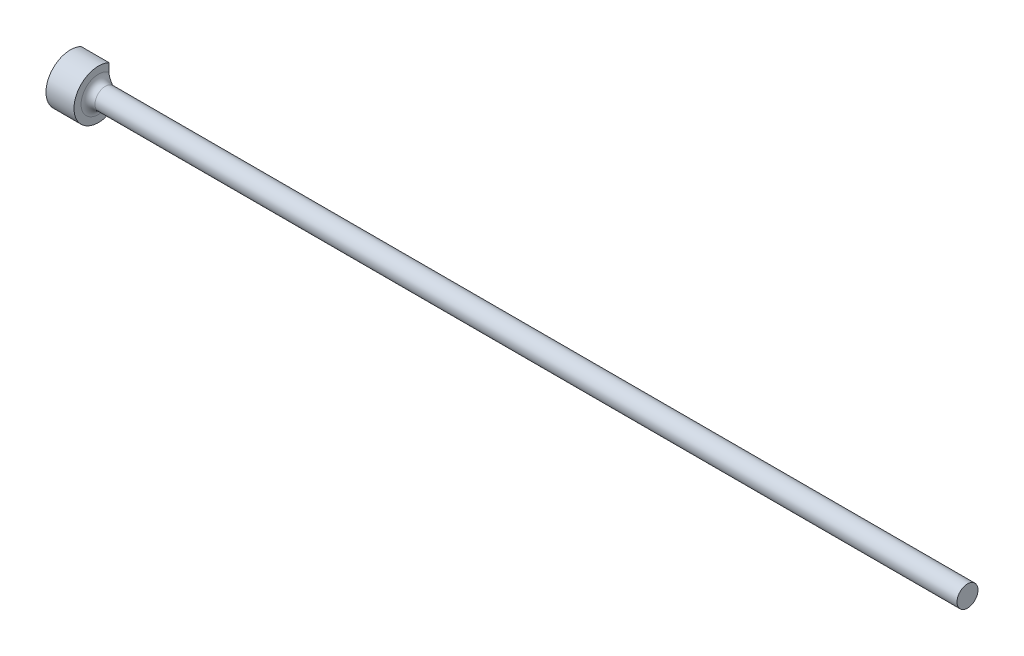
from build123d import *


with BuildPart() as part:
    # Sketch1 → PIN (revolve)
    with BuildSketch(Plane.XY, mode=Mode.PRIVATE) as pin_sk:
        with BuildLine():
            Line((0, 0), (0, 2.778125))
            Line((0, 2.778125), (3.175, 2.778125))
            Line((3.175, 2.778125), (3.175, 1.978025))
            ThreePointArc((3.175, 1.978025), (3.40562412, 1.42124912), (3.9624, 1.190625))
            Line((3.9624, 1.190625), (101.6, 1.190625))
            Line((101.6, 1.190625), (101.6, 0))
            Line((101.6, 0), (0, 0))
        make_face()
    revolve(pin_sk.sketch.rotate(Axis((101.6, 0, 0), (-1, 0, 0)), 180), axis=Axis((101.6, 0, 0), (-1, 0, 0)))

    # SurfaceCut1
    split(bisect_by=Plane(origin=(0, 0, -1.190879), x_dir=(-1, 0, 0), z_dir=(0, 0, -1)), keep=Keep.BOTTOM)


solid = part.part
